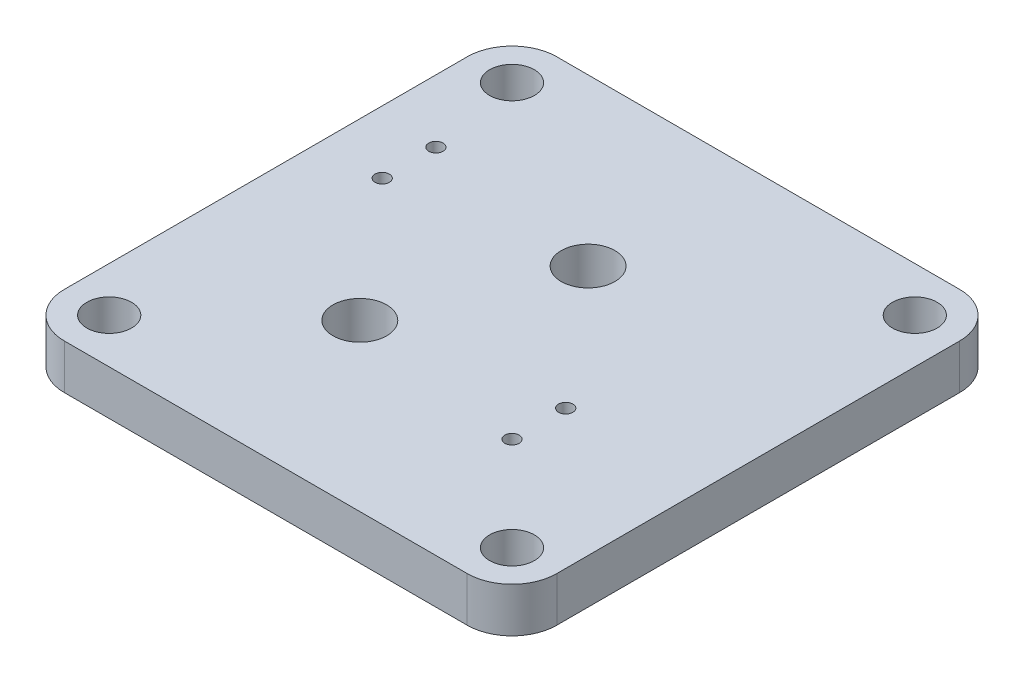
from build123d import *

# Parameters (mm, degrees)
ESQUISSE1_W             = 55
ESQUISSE1_H             = 55
BASE_EXTRUSION_DEPTH    = 5
CONG_1_R                = 5
ESQUISSE2_R             = 2.5
ENL_V_MAT_EXTRU_1_DEPTH = 40.210967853
ESQUISSE3_R             = 3
ESQUISSE3_R_2           = 0.8
ENL_V_MAT_EXTRU_2_DEPTH = 40.210967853


with BuildPart() as part:
    # Esquisse1 → Base-Extrusion (new body)
    with BuildSketch(Plane(origin=(0, 0, 0), x_dir=(1, 0, 0), z_dir=(0, 1, 0))):
        Rectangle(ESQUISSE1_W, ESQUISSE1_H)
    extrude(amount=BASE_EXTRUSION_DEPTH)

    # Cong_1
    cong_1_edges = [part.edges().sort_by_distance(p)[0] for p in [
        (-27.5, 2.5, -27.5),
        (27.5, 2.5, -27.5),
        (27.5, 2.5, 27.5),
        (-27.5, 2.5, 27.5),
    ]]
    fillet(cong_1_edges, radius=CONG_1_R)

    # Esquisse2 → Enl_v. mat.-Extru.1 (cut, through all)
    with BuildSketch(Plane(origin=(0, 5, 0), x_dir=(-1, 0, 0), z_dir=(0, 1, 0))):
        with Locations(Location((22.5, -22.5, 0), (0, 0, 90))):
            Circle(ESQUISSE2_R)
        with Locations(Location((-22.5, -22.5, 0), (0, 0, 270))):
            Circle(ESQUISSE2_R)
        with Locations(Location((-22.5, 22.5, 0), (0, 0, 90))):
            Circle(ESQUISSE2_R)
        with Locations(Location((22.5, 22.5, 0), (0, 0, 270))):
            Circle(ESQUISSE2_R)
    extrude(amount=-ENL_V_MAT_EXTRU_1_DEPTH, mode=Mode.SUBTRACT)

    # Esquisse3 → Enl_v. mat.-Extru.2 (cut, through all)
    with BuildSketch(Plane(origin=(0, 5, 0), x_dir=(-1, 0, 0), z_dir=(0, 1, 0))):
        with Locations(Location((8, 9, 0), (0, 0, 90))):
            Circle(ESQUISSE3_R)
        with Locations(Location((0.5, -9, 0), (0, 0, 90))):
            Circle(ESQUISSE3_R)
        with Locations(Location((20.5, -12, 0), (0, 0, 90))):
            Circle(ESQUISSE3_R_2)
        with Locations(Location((20.5, -6, 0), (0, 0, 270))):
            Circle(ESQUISSE3_R_2)
        with Locations(Location((-12, 6, 0), (0, 0, 90))):
            Circle(ESQUISSE3_R_2)
        with Locations(Location((-12, 12, 0), (0, 0, 270))):
            Circle(ESQUISSE3_R_2)
    extrude(amount=-ENL_V_MAT_EXTRU_2_DEPTH, mode=Mode.SUBTRACT)


solid = part.part
